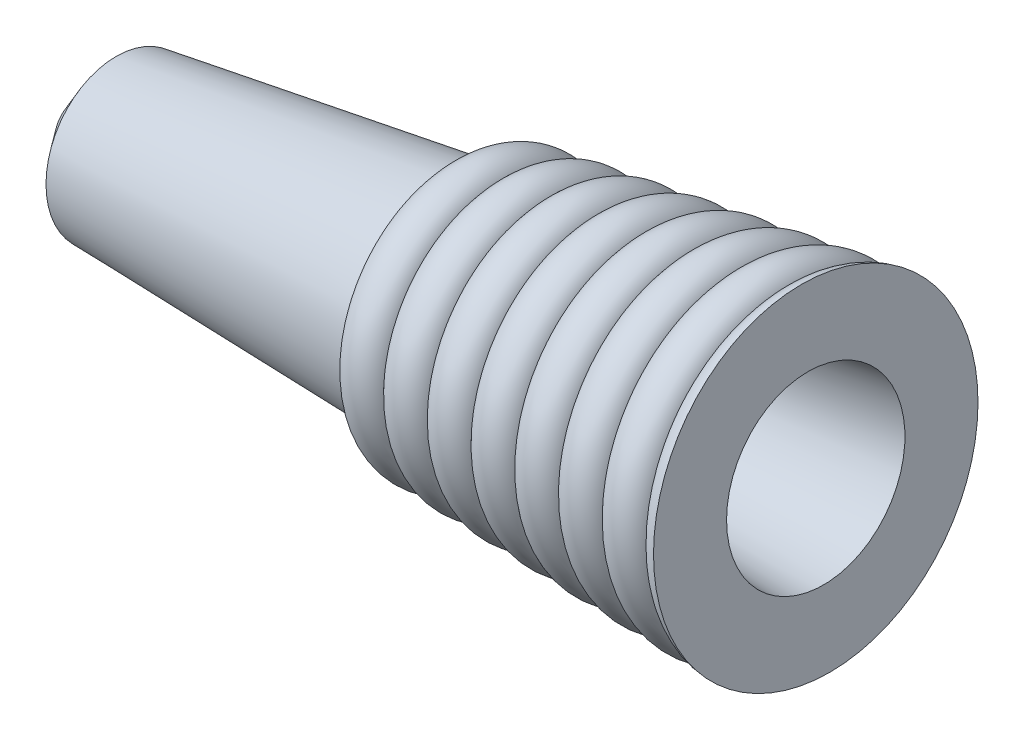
ISO-10303-21;
HEADER;
FILE_DESCRIPTION(('STEP AP214'),'2;1');
FILE_NAME('part.step','',(''),(''),'','','');
FILE_SCHEMA(('AUTOMOTIVE_DESIGN { 1 0 10303 214 1 1 1 1 }'));
ENDSEC;
DATA;
#1=APPLICATION_CONTEXT('core data for automotive mechanical design processes');
#2=APPLICATION_PROTOCOL_DEFINITION('international standard','automotive_design',2000,#1);
#3=PRODUCT_CONTEXT('',#1,'mechanical');
#4=PRODUCT('Part','Part','',(#3));
#5=PRODUCT_RELATED_PRODUCT_CATEGORY('part','',(#4));
#6=PRODUCT_DEFINITION_FORMATION('','',#4);
#7=PRODUCT_DEFINITION_CONTEXT('part definition',#1,'design');
#8=PRODUCT_DEFINITION('design','',#6,#7);
#9=PRODUCT_DEFINITION_SHAPE('','',#8);
#10=(LENGTH_UNIT() NAMED_UNIT(*) SI_UNIT(.MILLI.,.METRE.));
#11=(NAMED_UNIT(*) PLANE_ANGLE_UNIT() SI_UNIT($,.RADIAN.));
#12=(NAMED_UNIT(*) SI_UNIT($,.STERADIAN.) SOLID_ANGLE_UNIT());
#13=UNCERTAINTY_MEASURE_WITH_UNIT(LENGTH_MEASURE(1.E-05),#10,'distance_accuracy_value','');
#14=(GEOMETRIC_REPRESENTATION_CONTEXT(3) GLOBAL_UNCERTAINTY_ASSIGNED_CONTEXT((#13)) GLOBAL_UNIT_ASSIGNED_CONTEXT((#10,
#11,#12)) REPRESENTATION_CONTEXT('',''));
#15=CARTESIAN_POINT('',(0.,0.,0.));
#16=DIRECTION('',(0.,0.,1.));
#17=DIRECTION('',(1.,0.,0.));
#18=AXIS2_PLACEMENT_3D('',#15,#16,#17);
#19=CARTESIAN_POINT('',(96.8492990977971,11.6603437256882,0.));
#20=DIRECTION('',(-0.996194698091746,-0.0871557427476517,0.));
#21=DIRECTION('',(0.0871557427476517,-0.996194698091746,0.));
#22=AXIS2_PLACEMENT_3D('',#19,#20,#21);
#23=TOROIDAL_SURFACE('',#22,18.0791403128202,3.175);
#24=CARTESIAN_POINT('',(93.6984167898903,11.384677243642,0.));
#25=DIRECTION('',(-0.996194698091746,-0.0871557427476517,0.));
#26=DIRECTION('',(0.0871557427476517,-0.996194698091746,0.));
#27=AXIS2_PLACEMENT_3D('',#24,#25,#26);
#28=CIRCLE('',#27,17.8024208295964);
#29=CARTESIAN_POINT('',(95.25,-6.34999999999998,0.));
#30=VERTEX_POINT('',#29);
#31=EDGE_CURVE('E51',#30,#30,#28,.T.);
#32=ORIENTED_EDGE('',*,*,#31,.F.);
#33=EDGE_LOOP('',(#32));
#34=FACE_BOUND('',#33,.T.);
#35=CARTESIAN_POINT('',(96.5190442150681,11.6314501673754,0.));
#36=DIRECTION('',(0.996194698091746,0.0871557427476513,0.));
#37=DIRECTION('',(-0.0871557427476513,0.996194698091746,0.));
#38=AXIS2_PLACEMENT_3D('',#35,#36,#37);
#39=CIRCLE('',#38,21.2367853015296);
#40=CARTESIAN_POINT('',(94.6681364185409,32.7874230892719,0.));
#41=VERTEX_POINT('',#40);
#42=EDGE_CURVE('E46',#41,#41,#39,.F.);
#43=ORIENTED_EDGE('',*,*,#42,.T.);
#44=EDGE_LOOP('',(#43));
#45=FACE_BOUND('',#44,.T.);
#46=ADVANCED_FACE('F42',(#34,#45),#23,.T.);
#47=CARTESIAN_POINT('',(96.5190442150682,11.6314501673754,0.));
#48=DIRECTION('',(0.996194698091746,0.0871557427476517,0.));
#49=DIRECTION('',(-0.0871557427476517,0.996194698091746,0.));
#50=AXIS2_PLACEMENT_3D('',#47,#48,#49);
#51=CONICAL_SURFACE('',#50,11.6758804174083,0.08726646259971);
#52=CARTESIAN_POINT('',(-0.276719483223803,3.1629181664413,0.));
#53=DIRECTION('',(-0.996194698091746,-0.0871557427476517,0.));
#54=DIRECTION('',(0.0871557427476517,-0.996194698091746,0.));
#55=AXIS2_PLACEMENT_3D('',#52,#53,#54);
#56=CIRCLE('',#55,3.17500000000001);
#57=CARTESIAN_POINT('',(-0.553438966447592,6.3258363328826,0.));
#58=VERTEX_POINT('',#57);
#59=EDGE_CURVE('E90',#58,#58,#56,.T.);
#60=CARTESIAN_POINT('',(96.5190442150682,11.6314501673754,0.));
#61=DIRECTION('',(-0.996194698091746,-0.0871557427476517,0.));
#62=DIRECTION('',(0.0871557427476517,-0.996194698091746,0.));
#63=AXIS2_PLACEMENT_3D('',#60,#61,#62);
#64=CIRCLE('',#63,11.6758804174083);
#65=CARTESIAN_POINT('',(95.5014241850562,23.2629003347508,0.));
#66=VERTEX_POINT('',#65);
#67=EDGE_CURVE('E11',#66,#66,#64,.T.);
#68=CARTESIAN_POINT('',(-0.553438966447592,6.3258363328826,0.));
#69=CARTESIAN_POINT('',(0.447132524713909,6.50226408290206,0.));
#70=CARTESIAN_POINT('',(1.44770401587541,6.67869183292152,0.));
#71=CARTESIAN_POINT('',(3.44884699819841,7.03154733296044,0.));
#72=CARTESIAN_POINT('',(4.44941848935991,7.2079750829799,0.));
#73=CARTESIAN_POINT('',(6.4505614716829,7.56083058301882,0.));
#74=CARTESIAN_POINT('',(7.4511329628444,7.73725833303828,0.));
#75=CARTESIAN_POINT('',(9.45227594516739,8.0901138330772,0.));
#76=CARTESIAN_POINT('',(10.4528474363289,8.26654158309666,0.));
#77=CARTESIAN_POINT('',(12.4539904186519,8.61939708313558,0.));
#78=CARTESIAN_POINT('',(13.4545619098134,8.79582483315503,0.));
#79=CARTESIAN_POINT('',(15.4557048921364,9.14868033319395,0.));
#80=CARTESIAN_POINT('',(16.4562763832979,9.32510808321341,0.));
#81=CARTESIAN_POINT('',(18.4574193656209,9.67796358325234,0.));
#82=CARTESIAN_POINT('',(19.4579908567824,9.8543913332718,0.));
#83=CARTESIAN_POINT('',(21.4591338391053,10.2072468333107,0.));
#84=CARTESIAN_POINT('',(22.4597053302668,10.3836745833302,0.));
#85=CARTESIAN_POINT('',(24.4608483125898,10.7365300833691,0.));
#86=CARTESIAN_POINT('',(25.4614198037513,10.9129578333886,0.));
#87=CARTESIAN_POINT('',(27.4625627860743,11.2658133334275,0.));
#88=CARTESIAN_POINT('',(28.4631342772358,11.4422410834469,0.));
#89=CARTESIAN_POINT('',(30.4642772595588,11.7950965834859,0.));
#90=CARTESIAN_POINT('',(31.4648487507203,11.9715243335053,0.));
#91=CARTESIAN_POINT('',(33.4659917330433,12.3243798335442,0.));
#92=CARTESIAN_POINT('',(34.4665632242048,12.5008075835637,0.));
#93=CARTESIAN_POINT('',(36.4677062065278,12.8536630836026,0.));
#94=CARTESIAN_POINT('',(37.4682776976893,13.0300908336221,0.));
#95=CARTESIAN_POINT('',(39.4694206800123,13.382946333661,0.));
#96=CARTESIAN_POINT('',(40.4699921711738,13.5593740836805,0.));
#97=CARTESIAN_POINT('',(42.4711351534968,13.9122295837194,0.));
#98=CARTESIAN_POINT('',(43.4717066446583,14.0886573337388,0.));
#99=CARTESIAN_POINT('',(45.4728496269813,14.4415128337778,0.));
#100=CARTESIAN_POINT('',(46.4734211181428,14.6179405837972,0.));
#101=CARTESIAN_POINT('',(48.4745641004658,14.9707960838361,0.));
#102=CARTESIAN_POINT('',(49.4751355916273,15.1472238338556,0.));
#103=CARTESIAN_POINT('',(51.4762785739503,15.5000793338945,0.));
#104=CARTESIAN_POINT('',(52.4768500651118,15.676507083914,0.));
#105=CARTESIAN_POINT('',(54.4779930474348,16.0293625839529,0.));
#106=CARTESIAN_POINT('',(55.4785645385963,16.2057903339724,0.));
#107=CARTESIAN_POINT('',(57.4797075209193,16.5586458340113,0.));
#108=CARTESIAN_POINT('',(58.4802790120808,16.7350735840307,0.));
#109=CARTESIAN_POINT('',(60.4814219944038,17.0879290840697,0.));
#110=CARTESIAN_POINT('',(61.4819934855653,17.2643568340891,0.));
#111=CARTESIAN_POINT('',(63.4831364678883,17.617212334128,0.));
#112=CARTESIAN_POINT('',(64.4837079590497,17.7936400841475,0.));
#113=CARTESIAN_POINT('',(66.4848509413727,18.1464955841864,0.));
#114=CARTESIAN_POINT('',(67.4854224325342,18.3229233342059,0.));
#115=CARTESIAN_POINT('',(69.4865654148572,18.6757788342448,0.));
#116=CARTESIAN_POINT('',(70.4871369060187,18.8522065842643,0.));
#117=CARTESIAN_POINT('',(72.4882798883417,19.2050620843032,0.));
#118=CARTESIAN_POINT('',(73.4888513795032,19.3814898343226,0.));
#119=CARTESIAN_POINT('',(75.4899943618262,19.7343453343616,0.));
#120=CARTESIAN_POINT('',(76.4905658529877,19.910773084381,0.));
#121=CARTESIAN_POINT('',(78.4917088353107,20.2636285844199,0.));
#122=CARTESIAN_POINT('',(79.4922803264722,20.4400563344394,0.));
#123=CARTESIAN_POINT('',(81.4934233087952,20.7929118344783,0.));
#124=CARTESIAN_POINT('',(82.4939947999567,20.9693395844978,0.));
#125=CARTESIAN_POINT('',(84.4951377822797,21.3221950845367,0.));
#126=CARTESIAN_POINT('',(85.4957092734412,21.4986228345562,0.));
#127=CARTESIAN_POINT('',(87.4968522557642,21.8514783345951,0.));
#128=CARTESIAN_POINT('',(88.4974237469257,22.0279060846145,0.));
#129=CARTESIAN_POINT('',(90.4985667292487,22.3807615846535,0.));
#130=CARTESIAN_POINT('',(91.4991382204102,22.5571893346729,0.));
#131=CARTESIAN_POINT('',(93.5002812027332,22.9100448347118,0.));
#132=CARTESIAN_POINT('',(94.5008526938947,23.0864725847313,0.));
#133=CARTESIAN_POINT('',(95.5014241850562,23.2629003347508,0.));
#134=B_SPLINE_CURVE_WITH_KNOTS('',3,(#68,#69,#70,#71,#72,#73,#74,#75,#76,#77,#78,#79,#80,#81,
#82,#83,#84,#85,#86,#87,#88,#89,#90,#91,#92,#93,#94,#95,#96,#97,#98,#99,#100,#101,#102,#103,
#104,#105,#106,#107,#108,#109,#110,#111,#112,#113,#114,#115,#116,#117,#118,#119,#120,#121,#122,
#123,#124,#125,#126,#127,#128,#129,#130,#131,#132,#133),.UNSPECIFIED.,.F.,.F.,(4,2,2,2,2,2,2,2,
2,2,2,2,2,2,2,2,2,2,2,2,2,2,2,2,2,2,2,2,2,2,2,2,4),(0.,3.04802075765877,6.09604151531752,
9.14406227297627,12.192083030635,15.2401037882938,18.2881245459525,21.3361453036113,
24.38416606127,27.4321868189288,30.4802075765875,33.5282283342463,36.576249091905,
39.6242698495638,42.6722906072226,45.7203113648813,48.7683321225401,51.8163528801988,
54.8643736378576,57.9123943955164,60.9604151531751,64.0084359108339,67.0564566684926,
70.1044774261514,73.1524981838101,76.2005189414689,79.2485396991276,82.2965604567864,
85.3445812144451,88.3926019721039,91.4406227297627,94.4886434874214,97.5366642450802),.UNSPECIFIED.);
#135=EDGE_CURVE('BSEAM44',#58,#66,#134,.T.);
#136=ORIENTED_EDGE('',*,*,#59,.T.);
#137=ORIENTED_EDGE('',*,*,#67,.F.);
#138=ORIENTED_EDGE('',*,*,#135,.T.);
#139=ORIENTED_EDGE('',*,*,#135,.F.);
#140=EDGE_LOOP('',(#136,#138,#137,#139));
#141=FACE_BOUND('',#140,.T.);
#142=ADVANCED_FACE('F44',(#141),#51,.F.);
#143=CARTESIAN_POINT('',(90.5475344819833,11.1090107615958,0.));
#144=DIRECTION('',(-0.996194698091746,-0.0871557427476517,0.));
#145=DIRECTION('',(0.0871557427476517,-0.996194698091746,0.));
#146=AXIS2_PLACEMENT_3D('',#143,#144,#145);
#147=TOROIDAL_SURFACE('',#146,17.5257013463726,3.175);
#148=ORIENTED_EDGE('',*,*,#31,.T.);
#149=EDGE_LOOP('',(#148));
#150=FACE_BOUND('',#149,.T.);
#151=CARTESIAN_POINT('',(87.3966521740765,10.8333442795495,0.));
#152=DIRECTION('',(-0.996194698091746,-0.0871557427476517,0.));
#153=DIRECTION('',(0.0871557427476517,-0.996194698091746,0.));
#154=AXIS2_PLACEMENT_3D('',#151,#152,#153);
#155=CIRCLE('',#154,17.2489818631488);
#156=CARTESIAN_POINT('',(88.9,-6.34999999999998,0.));
#157=VERTEX_POINT('',#156);
#158=EDGE_CURVE('E56',#157,#157,#155,.T.);
#159=ORIENTED_EDGE('',*,*,#158,.F.);
#160=EDGE_LOOP('',(#159));
#161=FACE_BOUND('',#160,.T.);
#162=ADVANCED_FACE('F115',(#150,#161),#147,.T.);
#163=CARTESIAN_POINT('',(84.2457698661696,10.5576777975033,0.));
#164=DIRECTION('',(-0.996194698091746,-0.0871557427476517,0.));
#165=DIRECTION('',(0.0871557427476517,-0.996194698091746,0.));
#166=AXIS2_PLACEMENT_3D('',#163,#164,#165);
#167=TOROIDAL_SURFACE('',#166,16.972262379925,3.175);
#168=ORIENTED_EDGE('',*,*,#158,.T.);
#169=EDGE_LOOP('',(#168));
#170=FACE_BOUND('',#169,.T.);
#171=CARTESIAN_POINT('',(81.0948875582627,10.2820113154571,0.));
#172=DIRECTION('',(-0.996194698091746,-0.0871557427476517,0.));
#173=DIRECTION('',(0.0871557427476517,-0.996194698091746,0.));
#174=AXIS2_PLACEMENT_3D('',#171,#172,#173);
#175=CIRCLE('',#174,16.6955428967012);
#176=CARTESIAN_POINT('',(82.55,-6.34999999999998,0.));
#177=VERTEX_POINT('',#176);
#178=EDGE_CURVE('E62',#177,#177,#175,.T.);
#179=ORIENTED_EDGE('',*,*,#178,.F.);
#180=EDGE_LOOP('',(#179));
#181=FACE_BOUND('',#180,.T.);
#182=ADVANCED_FACE('F120',(#170,#181),#167,.T.);
#183=CARTESIAN_POINT('',(77.9440052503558,10.0063448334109,0.));
#184=DIRECTION('',(-0.996194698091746,-0.0871557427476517,0.));
#185=DIRECTION('',(0.0871557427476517,-0.996194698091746,0.));
#186=AXIS2_PLACEMENT_3D('',#183,#184,#185);
#187=TOROIDAL_SURFACE('',#186,16.4188234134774,3.175);
#188=ORIENTED_EDGE('',*,*,#178,.T.);
#189=EDGE_LOOP('',(#188));
#190=FACE_BOUND('',#189,.T.);
#191=CARTESIAN_POINT('',(74.7931229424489,9.73067835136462,0.));
#192=DIRECTION('',(-0.996194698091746,-0.0871557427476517,0.));
#193=DIRECTION('',(0.0871557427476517,-0.996194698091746,0.));
#194=AXIS2_PLACEMENT_3D('',#191,#192,#193);
#195=CIRCLE('',#194,16.1421039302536);
#196=CARTESIAN_POINT('',(76.2,-6.34999999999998,0.));
#197=VERTEX_POINT('',#196);
#198=EDGE_CURVE('E66',#197,#197,#195,.T.);
#199=ORIENTED_EDGE('',*,*,#198,.F.);
#200=EDGE_LOOP('',(#199));
#201=FACE_BOUND('',#200,.T.);
#202=ADVANCED_FACE('F124',(#190,#201),#187,.T.);
#203=CARTESIAN_POINT('',(71.642240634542,9.45501186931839,0.));
#204=DIRECTION('',(-0.996194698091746,-0.0871557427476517,0.));
#205=DIRECTION('',(0.0871557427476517,-0.996194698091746,0.));
#206=AXIS2_PLACEMENT_3D('',#203,#204,#205);
#207=TOROIDAL_SURFACE('',#206,15.8653844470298,3.175);
#208=ORIENTED_EDGE('',*,*,#198,.T.);
#209=EDGE_LOOP('',(#208));
#210=FACE_BOUND('',#209,.T.);
#211=CARTESIAN_POINT('',(68.4913583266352,9.17934538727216,0.));
#212=DIRECTION('',(-0.996194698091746,-0.0871557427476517,0.));
#213=DIRECTION('',(0.0871557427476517,-0.996194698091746,0.));
#214=AXIS2_PLACEMENT_3D('',#211,#212,#213);
#215=CIRCLE('',#214,15.588664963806);
#216=CARTESIAN_POINT('',(69.85,-6.34999999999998,0.));
#217=VERTEX_POINT('',#216);
#218=EDGE_CURVE('E70',#217,#217,#215,.T.);
#219=ORIENTED_EDGE('',*,*,#218,.F.);
#220=EDGE_LOOP('',(#219));
#221=FACE_BOUND('',#220,.T.);
#222=ADVANCED_FACE('F128',(#210,#221),#207,.T.);
#223=CARTESIAN_POINT('',(65.3404760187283,8.90367890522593,0.));
#224=DIRECTION('',(-0.996194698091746,-0.0871557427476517,0.));
#225=DIRECTION('',(0.0871557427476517,-0.996194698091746,0.));
#226=AXIS2_PLACEMENT_3D('',#223,#224,#225);
#227=TOROIDAL_SURFACE('',#226,15.3119454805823,3.175);
#228=ORIENTED_EDGE('',*,*,#218,.T.);
#229=EDGE_LOOP('',(#228));
#230=FACE_BOUND('',#229,.T.);
#231=CARTESIAN_POINT('',(62.1895937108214,8.6280124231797,0.));
#232=DIRECTION('',(-0.996194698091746,-0.0871557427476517,0.));
#233=DIRECTION('',(0.0871557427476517,-0.996194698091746,0.));
#234=AXIS2_PLACEMENT_3D('',#231,#232,#233);
#235=CIRCLE('',#234,15.0352259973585);
#236=CARTESIAN_POINT('',(63.5,-6.34999999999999,0.));
#237=VERTEX_POINT('',#236);
#238=EDGE_CURVE('E74',#237,#237,#235,.T.);
#239=ORIENTED_EDGE('',*,*,#238,.F.);
#240=EDGE_LOOP('',(#239));
#241=FACE_BOUND('',#240,.T.);
#242=ADVANCED_FACE('F132',(#230,#241),#227,.T.);
#243=CARTESIAN_POINT('',(59.0387114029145,8.35234594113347,0.));
#244=DIRECTION('',(-0.996194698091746,-0.0871557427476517,0.));
#245=DIRECTION('',(0.0871557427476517,-0.996194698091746,0.));
#246=AXIS2_PLACEMENT_3D('',#243,#244,#245);
#247=TOROIDAL_SURFACE('',#246,14.7585065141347,3.175);
#248=ORIENTED_EDGE('',*,*,#238,.T.);
#249=EDGE_LOOP('',(#248));
#250=FACE_BOUND('',#249,.T.);
#251=CARTESIAN_POINT('',(55.8878290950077,8.07667945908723,0.));
#252=DIRECTION('',(-0.996194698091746,-0.0871557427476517,0.));
#253=DIRECTION('',(0.0871557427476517,-0.996194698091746,0.));
#254=AXIS2_PLACEMENT_3D('',#251,#252,#253);
#255=CIRCLE('',#254,14.4817870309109);
#256=CARTESIAN_POINT('',(57.15,-6.34999999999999,0.));
#257=VERTEX_POINT('',#256);
#258=EDGE_CURVE('E78',#257,#257,#255,.T.);
#259=ORIENTED_EDGE('',*,*,#258,.F.);
#260=EDGE_LOOP('',(#259));
#261=FACE_BOUND('',#260,.T.);
#262=ADVANCED_FACE('F136',(#250,#261),#247,.T.);
#263=CARTESIAN_POINT('',(52.7369467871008,7.801012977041,0.));
#264=DIRECTION('',(-0.996194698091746,-0.0871557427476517,0.));
#265=DIRECTION('',(0.0871557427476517,-0.996194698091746,0.));
#266=AXIS2_PLACEMENT_3D('',#263,#264,#265);
#267=TOROIDAL_SURFACE('',#266,14.2050675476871,3.175);
#268=ORIENTED_EDGE('',*,*,#258,.T.);
#269=EDGE_LOOP('',(#268));
#270=FACE_BOUND('',#269,.T.);
#271=CARTESIAN_POINT('',(49.5860644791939,7.52534649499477,0.));
#272=DIRECTION('',(-0.996194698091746,-0.0871557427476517,0.));
#273=DIRECTION('',(0.0871557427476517,-0.996194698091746,0.));
#274=AXIS2_PLACEMENT_3D('',#271,#272,#273);
#275=CIRCLE('',#274,13.9283480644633);
#276=CARTESIAN_POINT('',(50.8,-6.35000000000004,0.));
#277=VERTEX_POINT('',#276);
#278=EDGE_CURVE('E82',#277,#277,#275,.T.);
#279=ORIENTED_EDGE('',*,*,#278,.F.);
#280=EDGE_LOOP('',(#279));
#281=FACE_BOUND('',#280,.T.);
#282=ADVANCED_FACE('F140',(#270,#281),#267,.T.);
#283=CARTESIAN_POINT('',(5.47371216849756,3.66601574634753,0.));
#284=DIRECTION('',(0.996194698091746,0.0871557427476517,0.));
#285=DIRECTION('',(-0.0871557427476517,0.996194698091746,0.));
#286=AXIS2_PLACEMENT_3D('',#283,#284,#285);
#287=CONICAL_SURFACE('',#286,10.0542752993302,0.0872664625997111);
#288=ORIENTED_EDGE('',*,*,#278,.T.);
#289=EDGE_LOOP('',(#288));
#290=FACE_BOUND('',#289,.T.);
#291=CARTESIAN_POINT('',(5.47371216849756,3.66601574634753,0.));
#292=DIRECTION('',(-0.996194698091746,-0.0871557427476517,0.));
#293=DIRECTION('',(0.0871557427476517,-0.996194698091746,0.));
#294=AXIS2_PLACEMENT_3D('',#291,#292,#293);
#295=CIRCLE('',#294,10.0542752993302);
#296=CARTESIAN_POINT('',(4.59742433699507,13.6820314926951,0.));
#297=VERTEX_POINT('',#296);
#298=EDGE_CURVE('E86',#297,#297,#295,.T.);
#299=ORIENTED_EDGE('',*,*,#298,.F.);
#300=EDGE_LOOP('',(#299));
#301=FACE_BOUND('',#300,.T.);
#302=ADVANCED_FACE('F107',(#290,#301),#287,.T.);
#303=CARTESIAN_POINT('',(-0.276719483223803,3.1629181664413,0.));
#304=DIRECTION('',(0.996194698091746,0.0871557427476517,0.));
#305=DIRECTION('',(-0.0871557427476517,0.996194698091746,0.));
#306=AXIS2_PLACEMENT_3D('',#303,#304,#305);
#307=CONICAL_SURFACE('',#306,3.175,0.872664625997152);
#308=CARTESIAN_POINT('',(4.59742433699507,13.6820314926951,0.));
#309=CARTESIAN_POINT('',(4.54376951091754,13.6054044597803,0.));
#310=CARTESIAN_POINT('',(4.49011468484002,13.5287774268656,0.));
#311=CARTESIAN_POINT('',(4.38280503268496,13.3755233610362,0.));
#312=CARTESIAN_POINT('',(4.32915020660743,13.2988963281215,0.));
#313=CARTESIAN_POINT('',(4.22184055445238,13.1456422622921,0.));
#314=CARTESIAN_POINT('',(4.16818572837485,13.0690152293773,0.));
#315=CARTESIAN_POINT('',(4.06087607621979,12.9157611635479,0.));
#316=CARTESIAN_POINT('',(4.00722125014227,12.8391341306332,0.));
#317=CARTESIAN_POINT('',(3.89991159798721,12.6858800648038,0.));
#318=CARTESIAN_POINT('',(3.84625677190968,12.6092530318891,0.));
#319=CARTESIAN_POINT('',(3.73894711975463,12.4559989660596,0.));
#320=CARTESIAN_POINT('',(3.6852922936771,12.3793719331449,0.));
#321=CARTESIAN_POINT('',(3.57798264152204,12.2261178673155,0.));
#322=CARTESIAN_POINT('',(3.52432781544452,12.1494908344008,0.));
#323=CARTESIAN_POINT('',(3.41701816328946,11.9962367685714,0.));
#324=CARTESIAN_POINT('',(3.36336333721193,11.9196097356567,0.));
#325=CARTESIAN_POINT('',(3.25605368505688,11.7663556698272,0.));
#326=CARTESIAN_POINT('',(3.20239885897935,11.6897286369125,0.));
#327=CARTESIAN_POINT('',(3.09508920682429,11.5364745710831,0.));
#328=CARTESIAN_POINT('',(3.04143438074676,11.4598475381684,0.));
#329=CARTESIAN_POINT('',(2.93412472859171,11.3065934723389,0.));
#330=CARTESIAN_POINT('',(2.88046990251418,11.2299664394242,0.));
#331=CARTESIAN_POINT('',(2.77316025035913,11.0767123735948,0.));
#332=CARTESIAN_POINT('',(2.7195054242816,11.0000853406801,0.));
#333=CARTESIAN_POINT('',(2.61219577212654,10.8468312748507,0.));
#334=CARTESIAN_POINT('',(2.55854094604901,10.770204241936,0.));
#335=CARTESIAN_POINT('',(2.45123129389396,10.6169501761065,0.));
#336=CARTESIAN_POINT('',(2.39757646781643,10.5403231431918,0.));
#337=CARTESIAN_POINT('',(2.29026681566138,10.3870690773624,0.));
#338=CARTESIAN_POINT('',(2.23661198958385,10.3104420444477,0.));
#339=CARTESIAN_POINT('',(2.12930233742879,10.1571879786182,0.));
#340=CARTESIAN_POINT('',(2.07564751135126,10.0805609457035,0.));
#341=CARTESIAN_POINT('',(1.96833785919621,9.92730687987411,0.));
#342=CARTESIAN_POINT('',(1.91468303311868,9.8506798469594,0.));
#343=CARTESIAN_POINT('',(1.80737338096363,9.69742578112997,0.));
#344=CARTESIAN_POINT('',(1.7537185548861,9.62079874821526,0.));
#345=CARTESIAN_POINT('',(1.64640890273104,9.46754468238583,0.));
#346=CARTESIAN_POINT('',(1.59275407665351,9.39091764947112,0.));
#347=CARTESIAN_POINT('',(1.48544442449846,9.23766358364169,0.));
#348=CARTESIAN_POINT('',(1.43178959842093,9.16103655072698,0.));
#349=CARTESIAN_POINT('',(1.32447994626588,9.00778248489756,0.));
#350=CARTESIAN_POINT('',(1.27082512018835,8.93115545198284,0.));
#351=CARTESIAN_POINT('',(1.16351546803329,8.77790138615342,0.));
#352=CARTESIAN_POINT('',(1.10986064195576,8.7012743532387,0.));
#353=CARTESIAN_POINT('',(1.00255098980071,8.54802028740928,0.));
#354=CARTESIAN_POINT('',(0.948896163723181,8.47139325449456,0.));
#355=CARTESIAN_POINT('',(0.841586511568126,8.31813918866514,0.));
#356=CARTESIAN_POINT('',(0.787931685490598,8.24151215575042,0.));
#357=CARTESIAN_POINT('',(0.680622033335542,8.088258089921,0.));
#358=CARTESIAN_POINT('',(0.626967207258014,8.01163105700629,0.));
#359=CARTESIAN_POINT('',(0.519657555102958,7.85837699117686,0.));
#360=CARTESIAN_POINT('',(0.466002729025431,7.78174995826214,0.));
#361=CARTESIAN_POINT('',(0.358693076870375,7.62849589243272,0.));
#362=CARTESIAN_POINT('',(0.305038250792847,7.55186885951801,0.));
#363=CARTESIAN_POINT('',(0.197728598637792,7.39861479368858,0.));
#364=CARTESIAN_POINT('',(0.144073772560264,7.32198776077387,0.));
#365=CARTESIAN_POINT('',(0.0367641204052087,7.16873369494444,0.));
#366=CARTESIAN_POINT('',(-0.016890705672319,7.09210666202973,0.));
#367=CARTESIAN_POINT('',(-0.124200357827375,6.9388525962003,0.));
#368=CARTESIAN_POINT('',(-0.177855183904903,6.86222556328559,0.));
#369=CARTESIAN_POINT('',(-0.285164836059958,6.70897149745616,0.));
#370=CARTESIAN_POINT('',(-0.338819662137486,6.63234446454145,0.));
#371=CARTESIAN_POINT('',(-0.446129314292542,6.47909039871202,0.));
#372=CARTESIAN_POINT('',(-0.499784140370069,6.40246336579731,0.));
#373=CARTESIAN_POINT('',(-0.553438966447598,6.3258363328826,0.));
#374=B_SPLINE_CURVE_WITH_KNOTS('',3,(#308,#309,#310,#311,#312,#313,#314,#315,#316,#317,#318,
#319,#320,#321,#322,#323,#324,#325,#326,#327,#328,#329,#330,#331,#332,#333,#334,#335,#336,#337,
#338,#339,#340,#341,#342,#343,#344,#345,#346,#347,#348,#349,#350,#351,#352,#353,#354,#355,#356,
#357,#358,#359,#360,#361,#362,#363,#364,#365,#366,#367,#368,#369,#370,#371,#372,#373),
.UNSPECIFIED.,.F.,.F.,(4,2,2,2,2,2,2,2,2,2,2,2,2,2,2,2,2,2,2,2,2,2,2,2,2,2,2,2,2,2,2,2,4),(0.,
0.280633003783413,0.561266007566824,0.841899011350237,1.12253201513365,1.40316501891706,
1.68379802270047,1.96443102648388,2.2450640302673,2.52569703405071,2.80633003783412,
3.08696304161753,3.36759604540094,3.64822904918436,3.92886205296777,4.20949505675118,
4.49012806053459,4.77076106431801,5.05139406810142,5.33202707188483,5.61266007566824,
5.89329307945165,6.17392608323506,6.45455908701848,6.73519209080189,7.0158250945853,
7.29645809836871,7.57709110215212,7.85772410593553,8.13835710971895,8.41899011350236,
8.69962311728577,8.98025612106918),.UNSPECIFIED.);
#375=EDGE_CURVE('BSEAM102',#297,#58,#374,.T.);
#376=ORIENTED_EDGE('',*,*,#298,.T.);
#377=ORIENTED_EDGE('',*,*,#59,.F.);
#378=ORIENTED_EDGE('',*,*,#375,.T.);
#379=ORIENTED_EDGE('',*,*,#375,.F.);
#380=EDGE_LOOP('',(#376,#378,#377,#379));
#381=FACE_BOUND('',#380,.T.);
#382=ADVANCED_FACE('F102',(#381),#307,.T.);
#383=CARTESIAN_POINT('',(96.7957636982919,8.46853200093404,0.));
#384=DIRECTION('',(0.996194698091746,0.0871557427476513,0.));
#385=DIRECTION('',(-0.0871557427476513,0.996194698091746,0.));
#386=AXIS2_PLACEMENT_3D('',#383,#384,#385);
#387=PLANE('',#386);
#388=ORIENTED_EDGE('',*,*,#67,.T.);
#389=EDGE_LOOP('',(#388));
#390=FACE_BOUND('',#389,.T.);
#391=ORIENTED_EDGE('',*,*,#42,.F.);
#392=EDGE_LOOP('',(#391));
#393=FACE_BOUND('',#392,.T.);
#394=ADVANCED_FACE('F100',(#390,#393),#387,.T.);
#395=CLOSED_SHELL('',(#46,#142,#162,#182,#202,#222,#242,#262,#282,#302,#382,#394));
#396=MANIFOLD_SOLID_BREP('B2',#395);
#397=ADVANCED_BREP_SHAPE_REPRESENTATION('',(#18,#396),#14);
#398=SHAPE_DEFINITION_REPRESENTATION(#9,#397);
ENDSEC;
END-ISO-10303-21;
